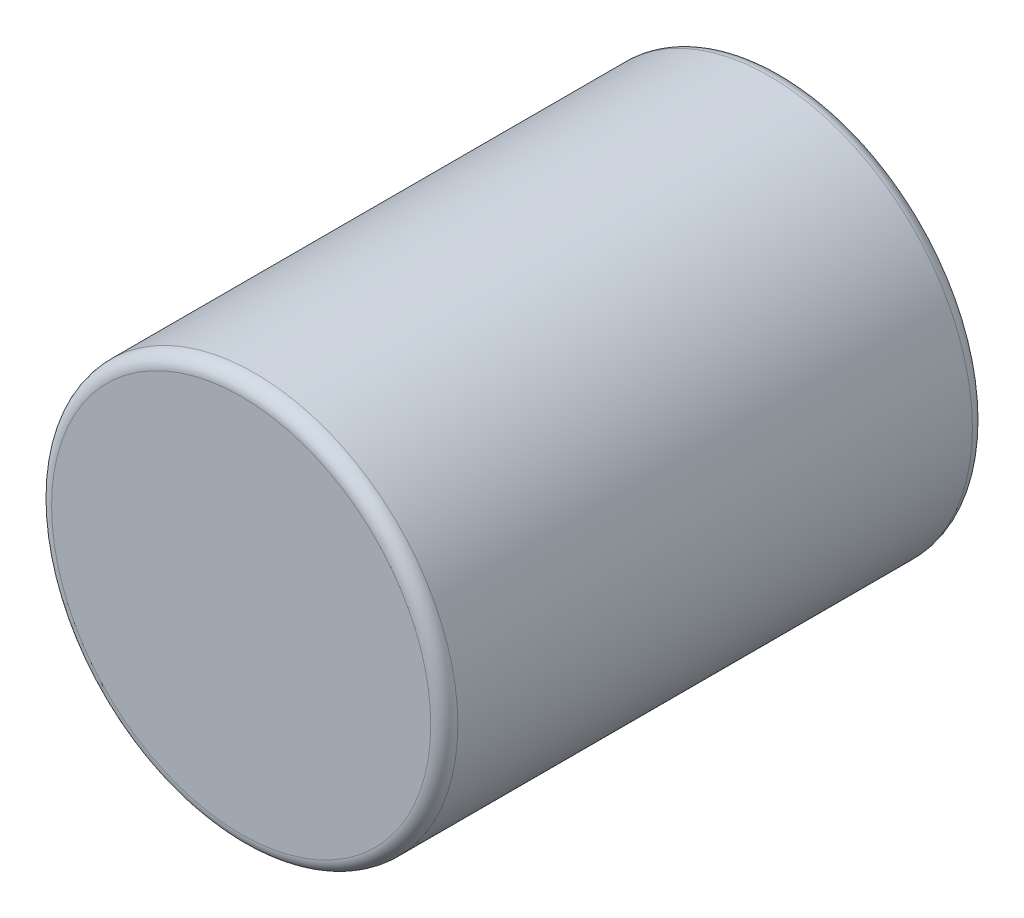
from build123d import *

# Parameters (mm, degrees)
ESQUISSE1_R        = 1.5
BOSS_EXTRU_1_DEPTH = 4
CONG_1_R           = 0.1


with BuildPart() as part:
    # Esquisse1 → Boss.-Extru.1 (new body)
    with BuildSketch(Plane.XY):
        Circle(ESQUISSE1_R)
    extrude(amount=BOSS_EXTRU_1_DEPTH)

    # Cong_1
    cong_1_edges = [part.edges().sort_by_distance(p)[0] for p in [
        (-1.5, 0, 0),
        (-1.5, 0, 4),
    ]]
    fillet(cong_1_edges, radius=CONG_1_R)


solid = part.part
